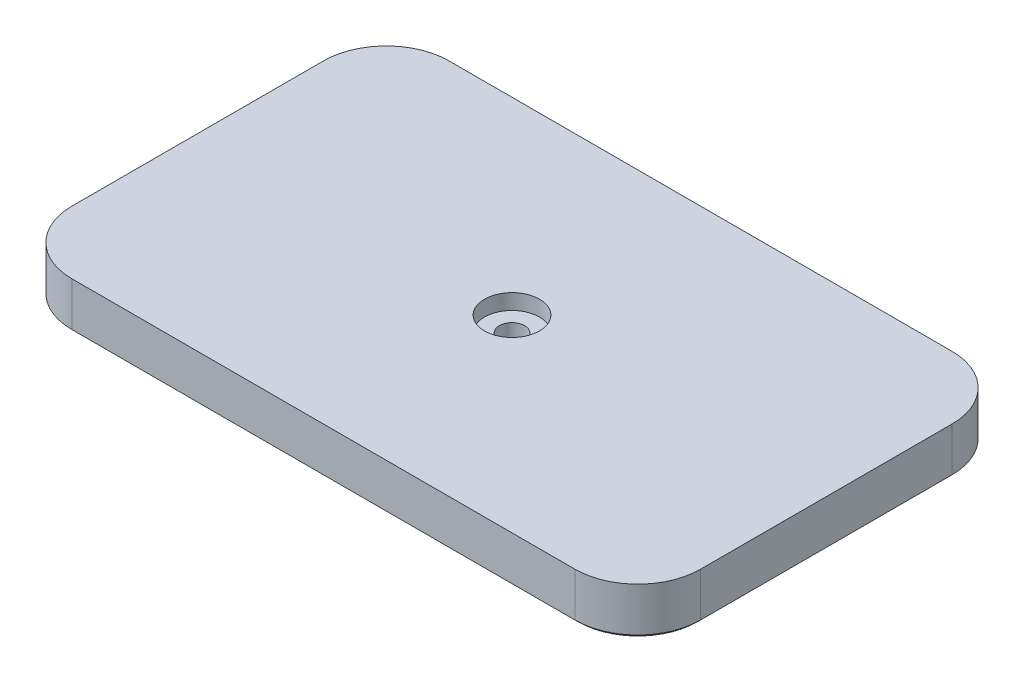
from build123d import *

# Parameters (mm, degrees)
SKETCH1_W                                           = 127
SKETCH1_H                                           = 76.2
EXTRUDE1_DEPTH                                      = 9.525
FILLET1_R                                           = 12.7
CHAMFER1_SIZE                                       = 0.635
CBORE_FOR_10_BINDING_HEAD_MACHINE_SCREW_D           = 5.1054
CBORE_FOR_10_BINDING_HEAD_MACHINE_SCREW_CBORE_D     = 11.1125
CBORE_FOR_10_BINDING_HEAD_MACHINE_SCREW_CBORE_DEPTH = 3.1242


with BuildPart() as part:
    # Sketch1 → Extrude1 (new body)
    with BuildSketch(Plane(origin=(0, 0, 0), x_dir=(1, 0, 0), z_dir=(0, 1, 0))):
        Rectangle(SKETCH1_W, SKETCH1_H)
    extrude(amount=EXTRUDE1_DEPTH)

    # Fillet1
    fillet1_edges = [part.edges().sort_by_distance(p)[0] for p in [
        (-63.5, 4.7625, -38.1),
        (63.5, 4.7625, -38.1),
        (63.5, 4.7625, 38.1),
        (-63.5, 4.7625, 38.1),
    ]]
    fillet(fillet1_edges, radius=FILLET1_R)

    # Chamfer1
    chamfer1_edges = [part.edges().sort_by_distance(p)[0] for p in [
        (-63.5, 0, 0),
        (0, 0, -38.1),
        (63.5, 0, 0),
        (0, 0, 38.1),
        (59.780256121, 0, 34.380256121),
        (-59.780256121, 0, 34.380256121),
        (59.780256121, 0, -34.380256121),
        (-59.780256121, 0, -34.380256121),
    ]]
    chamfer(chamfer1_edges, length=CHAMFER1_SIZE)

    # CBORE for _10 Binding Head Machine Screw (through all)
    with Locations(Plane(origin=(0, 9.525, 0), x_dir=(-1, 0, 0), z_dir=(0, 1, 0))):
        with Locations((0, 0)):
            CounterBoreHole(CBORE_FOR_10_BINDING_HEAD_MACHINE_SCREW_D / 2, CBORE_FOR_10_BINDING_HEAD_MACHINE_SCREW_CBORE_D / 2, CBORE_FOR_10_BINDING_HEAD_MACHINE_SCREW_CBORE_DEPTH)


solid = part.part
